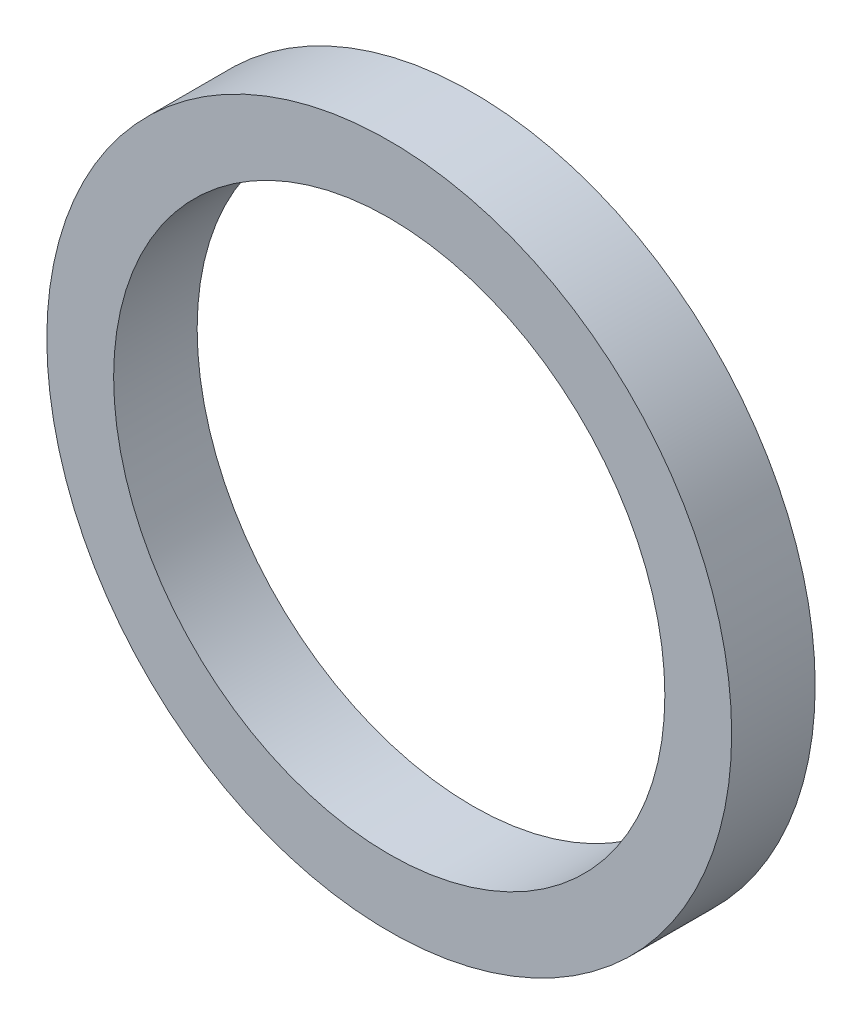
from build123d import *

# Parameters (mm, degrees)
SKETCH_1_R      = 10.25
SKETCH_1_R_2    = 8.25
EXTRUDE_1_DEPTH = 2.5


with BuildPart() as part:
    # Sketch 1 → Extrude 1 (new body)
    with BuildSketch(Plane.XY):
        Circle(SKETCH_1_R)
        Circle(SKETCH_1_R_2, mode=Mode.SUBTRACT)
    extrude(amount=EXTRUDE_1_DEPTH)


solid = part.part
